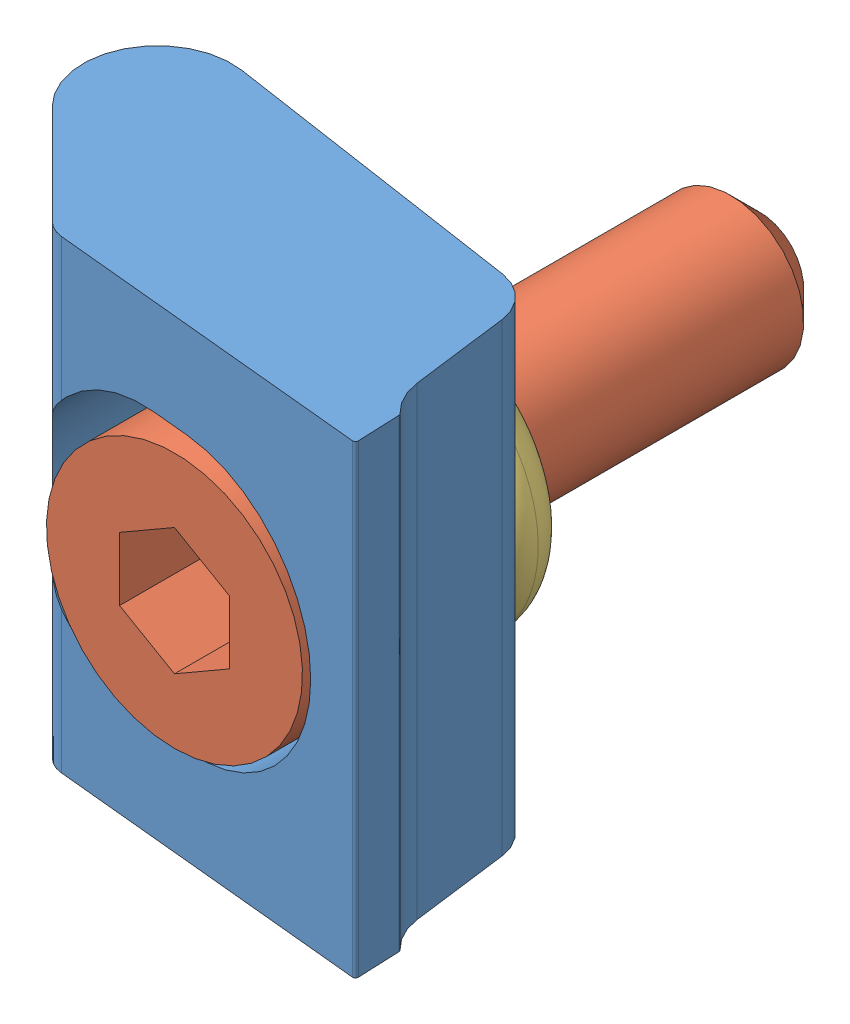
SolidWorks assembly MBSC04TC.sldasm, configuration Default (file format 15000). Lengths in mm.
Overall size (12.7 12.7 16.13).
3 component instances, 3 part files, 0 mates.
Components (placement in the parent):
- MBSC04TC_01-1: MBSC04TC_01.SLDPRT [ﾃﾞﾌｫﾙﾄ] at origin size (12.7 12.7 7.28)
- MBSC04TC_02-1: MBSC04TC_02.SLDPRT [ﾃﾞﾌｫﾙﾄ] at (0 0 3.1496) size (7 7 16)
- MBSC04TC_03-1: MBSC04TC_03.SLDPRT [ﾃﾞﾌｫﾙﾄ] at origin size (7.37 7.37 1.78)
